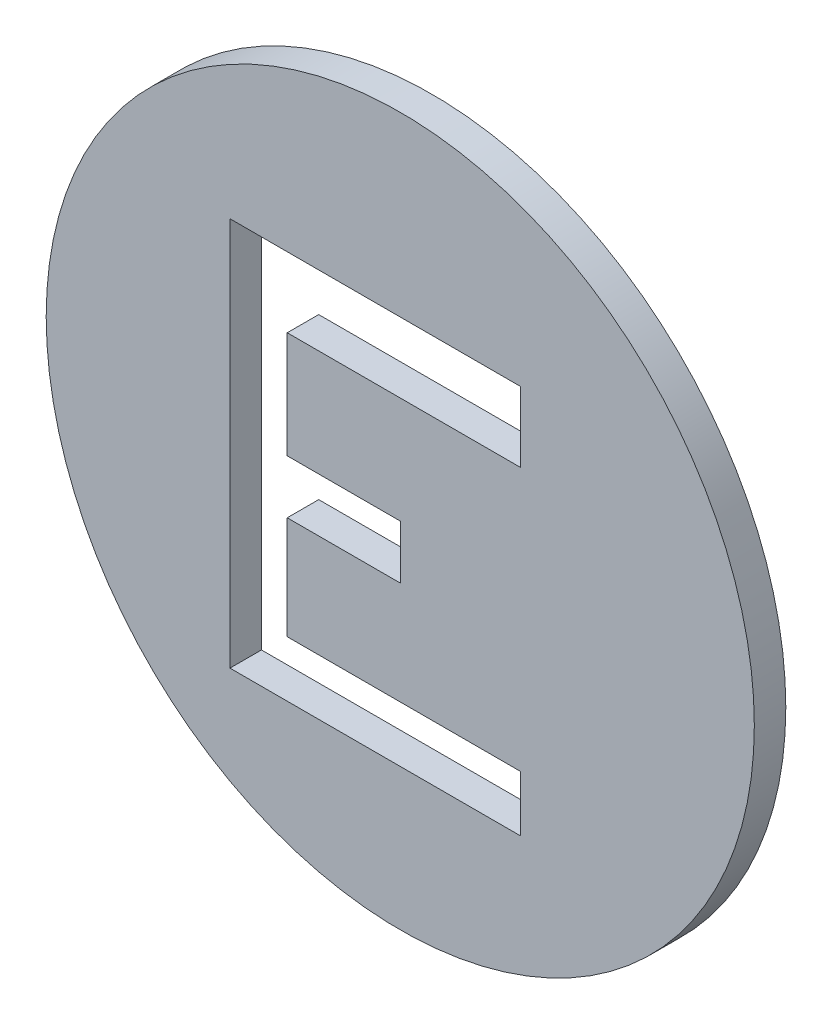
from build123d import *

# Parameters (mm, degrees)
SKETCH1_R           = 45
BOSS_EXTRUDE1_DEPTH = 4
CUT_EXTRUDE1_DEPTH  = 4


with BuildPart() as part:
    # Sketch1 → Boss-Extrude1 (new body)
    with BuildSketch(Plane.XY):
        Circle(SKETCH1_R)
    extrude(amount=BOSS_EXTRUDE1_DEPTH)

    # Sketch2 → Cut-Extrude1 (cut)
    with BuildSketch(Plane.XY.offset(4)):
        Polygon((15.274906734, 22.457749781), (-21.639451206, 22.457749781), (-21.639451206, -27.003852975), (15.274906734, -27.003852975), (15.274906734, -19.911931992), (-14.365686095, -19.911931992), (-14.365686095, -6.819154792), (0, -6.819154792), (0, 0), (-14.365686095, 0), (-14.365686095, 13.54738752), (15.274906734, 13.54738752), align=None)
    extrude(amount=-CUT_EXTRUDE1_DEPTH, mode=Mode.SUBTRACT)


solid = part.part
